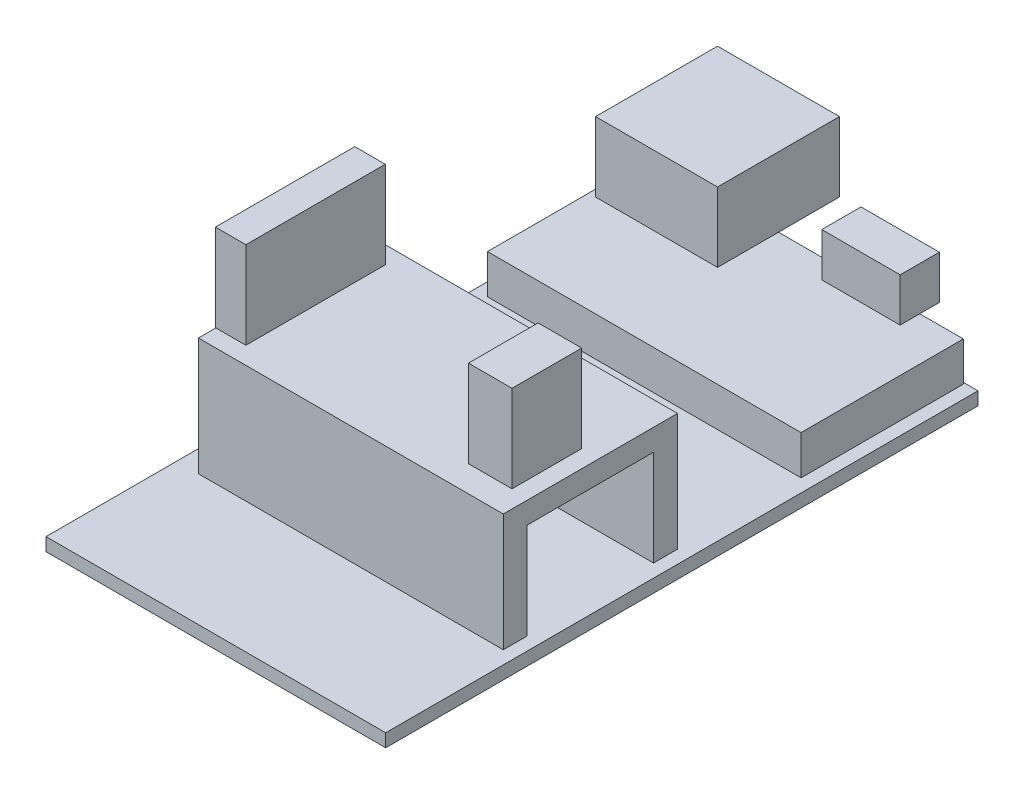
ISO-10303-21;
HEADER;
FILE_DESCRIPTION(('STEP AP214'),'2;1');
FILE_NAME('part.step','',(''),(''),'','','');
FILE_SCHEMA(('AUTOMOTIVE_DESIGN { 1 0 10303 214 1 1 1 1 }'));
ENDSEC;
DATA;
#1=APPLICATION_CONTEXT('core data for automotive mechanical design processes');
#2=APPLICATION_PROTOCOL_DEFINITION('international standard','automotive_design',2000,#1);
#3=PRODUCT_CONTEXT('',#1,'mechanical');
#4=PRODUCT('Part','Part','',(#3));
#5=PRODUCT_RELATED_PRODUCT_CATEGORY('part','',(#4));
#6=PRODUCT_DEFINITION_FORMATION('','',#4);
#7=PRODUCT_DEFINITION_CONTEXT('part definition',#1,'design');
#8=PRODUCT_DEFINITION('design','',#6,#7);
#9=PRODUCT_DEFINITION_SHAPE('','',#8);
#10=(LENGTH_UNIT() NAMED_UNIT(*) SI_UNIT(.MILLI.,.METRE.));
#11=(NAMED_UNIT(*) PLANE_ANGLE_UNIT() SI_UNIT($,.RADIAN.));
#12=(NAMED_UNIT(*) SI_UNIT($,.STERADIAN.) SOLID_ANGLE_UNIT());
#13=UNCERTAINTY_MEASURE_WITH_UNIT(LENGTH_MEASURE(1.E-05),#10,'distance_accuracy_value','');
#14=(GEOMETRIC_REPRESENTATION_CONTEXT(3) GLOBAL_UNCERTAINTY_ASSIGNED_CONTEXT((#13)) GLOBAL_UNIT_ASSIGNED_CONTEXT((#10,
#11,#12)) REPRESENTATION_CONTEXT('',''));
#15=CARTESIAN_POINT('',(0.,0.,0.));
#16=DIRECTION('',(0.,0.,1.));
#17=DIRECTION('',(1.,0.,0.));
#18=AXIS2_PLACEMENT_3D('',#15,#16,#17);
#19=CARTESIAN_POINT('',(0.,6.,0.));
#20=DIRECTION('',(0.,1.,0.));
#21=DIRECTION('',(0.,0.,1.));
#22=AXIS2_PLACEMENT_3D('',#19,#20,#21);
#23=PLANE('',#22);
#24=DIRECTION('',(-1.,0.,0.));
#25=VECTOR('',#24,1.);
#26=CARTESIAN_POINT('',(-18.,6.,-33.8120831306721));
#27=LINE('',#26,#25);
#28=CARTESIAN_POINT('',(18.,6.,-33.8120831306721));
#29=VERTEX_POINT('',#28);
#30=CARTESIAN_POINT('',(13.,6.,-33.8120831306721));
#31=VERTEX_POINT('',#30);
#32=EDGE_CURVE('E324',#29,#31,#27,.T.);
#33=ORIENTED_EDGE('',*,*,#32,.T.);
#34=DIRECTION('',(0.,0.,-1.));
#35=VECTOR('',#34,1.);
#36=CARTESIAN_POINT('',(13.,6.,-36.0620831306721));
#37=LINE('',#36,#35);
#38=CARTESIAN_POINT('',(13.,6.,-31.5620831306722));
#39=VERTEX_POINT('',#38);
#40=EDGE_CURVE('E55',#39,#31,#37,.T.);
#41=ORIENTED_EDGE('',*,*,#40,.F.);
#42=DIRECTION('',(1.,0.,0.));
#43=VECTOR('',#42,1.);
#44=CARTESIAN_POINT('',(4.,6.,-31.5620831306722));
#45=LINE('',#44,#43);
#46=CARTESIAN_POINT('',(4.,6.,-31.5620831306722));
#47=VERTEX_POINT('',#46);
#48=EDGE_CURVE('E50',#47,#39,#45,.T.);
#49=ORIENTED_EDGE('',*,*,#48,.F.);
#50=DIRECTION('',(0.,0.,1.));
#51=VECTOR('',#50,1.);
#52=CARTESIAN_POINT('',(4.,6.,-36.0620831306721));
#53=LINE('',#52,#51);
#54=CARTESIAN_POINT('',(4.,6.,-33.8120831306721));
#55=VERTEX_POINT('',#54);
#56=EDGE_CURVE('E542',#55,#47,#53,.T.);
#57=ORIENTED_EDGE('',*,*,#56,.F.);
#58=CARTESIAN_POINT('',(-3.21742454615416,6.,-33.8120831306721));
#59=VERTEX_POINT('',#58);
#60=EDGE_CURVE('E328',#55,#59,#27,.T.);
#61=ORIENTED_EDGE('',*,*,#60,.T.);
#62=DIRECTION('',(0.,0.,1.));
#63=VECTOR('',#62,1.);
#64=CARTESIAN_POINT('',(-3.21742454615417,6.,-40.8120831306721));
#65=LINE('',#64,#63);
#66=CARTESIAN_POINT('',(-3.21742454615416,6.,-26.8120831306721));
#67=VERTEX_POINT('',#66);
#68=EDGE_CURVE('E11',#59,#67,#65,.T.);
#69=ORIENTED_EDGE('',*,*,#68,.T.);
#70=DIRECTION('',(1.,0.,0.));
#71=VECTOR('',#70,1.);
#72=CARTESIAN_POINT('',(-17.2174245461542,6.,-26.8120831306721));
#73=LINE('',#72,#71);
#74=CARTESIAN_POINT('',(-17.2174245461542,6.,-26.8120831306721));
#75=VERTEX_POINT('',#74);
#76=EDGE_CURVE('E306',#75,#67,#73,.T.);
#77=ORIENTED_EDGE('',*,*,#76,.F.);
#78=DIRECTION('',(0.,0.,1.));
#79=VECTOR('',#78,1.);
#80=CARTESIAN_POINT('',(-17.2174245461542,6.,-40.8120831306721));
#81=LINE('',#80,#79);
#82=CARTESIAN_POINT('',(-17.2174245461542,6.,-33.8120831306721));
#83=VERTEX_POINT('',#82);
#84=EDGE_CURVE('E41',#83,#75,#81,.T.);
#85=ORIENTED_EDGE('',*,*,#84,.F.);
#86=CARTESIAN_POINT('',(-18.,6.,-33.8120831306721));
#87=VERTEX_POINT('',#86);
#88=EDGE_CURVE('E323',#83,#87,#27,.T.);
#89=ORIENTED_EDGE('',*,*,#88,.T.);
#90=DIRECTION('',(0.,0.,1.));
#91=VECTOR('',#90,1.);
#92=CARTESIAN_POINT('',(-18.,6.,-33.8120831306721));
#93=LINE('',#92,#91);
#94=CARTESIAN_POINT('',(-18.,6.,-15.1879168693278));
#95=VERTEX_POINT('',#94);
#96=EDGE_CURVE('E326',#87,#95,#93,.T.);
#97=ORIENTED_EDGE('',*,*,#96,.T.);
#98=DIRECTION('',(1.,0.,0.));
#99=VECTOR('',#98,1.);
#100=CARTESIAN_POINT('',(-18.,6.,-15.1879168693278));
#101=LINE('',#100,#99);
#102=CARTESIAN_POINT('',(18.,6.,-15.1879168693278));
#103=VERTEX_POINT('',#102);
#104=EDGE_CURVE('E331',#95,#103,#101,.T.);
#105=ORIENTED_EDGE('',*,*,#104,.T.);
#106=DIRECTION('',(0.,0.,-1.));
#107=VECTOR('',#106,1.);
#108=CARTESIAN_POINT('',(18.,6.,-33.8120831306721));
#109=LINE('',#108,#107);
#110=EDGE_CURVE('E313',#103,#29,#109,.T.);
#111=ORIENTED_EDGE('',*,*,#110,.T.);
#112=EDGE_LOOP('',(#33,#41,#49,#57,#61,#69,#77,#85,#89,#97,#105,#111));
#113=FACE_BOUND('',#112,.T.);
#114=ADVANCED_FACE('F32',(#113),#23,.T.);
#115=CARTESIAN_POINT('',(0.,1.5,0.));
#116=DIRECTION('',(0.,1.,0.));
#117=DIRECTION('',(0.,0.,1.));
#118=AXIS2_PLACEMENT_3D('',#115,#116,#117);
#119=PLANE('',#118);
#120=DIRECTION('',(-1.,0.,0.));
#121=VECTOR('',#120,1.);
#122=CARTESIAN_POINT('',(23.,1.5,16.2513258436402));
#123=LINE('',#122,#121);
#124=CARTESIAN_POINT('',(18.,1.5,16.2513258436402));
#125=VERTEX_POINT('',#124);
#126=CARTESIAN_POINT('',(-17.,1.5,16.2513258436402));
#127=VERTEX_POINT('',#126);
#128=EDGE_CURVE('E365',#125,#127,#123,.T.);
#129=ORIENTED_EDGE('',*,*,#128,.F.);
#130=DIRECTION('',(0.,0.,1.));
#131=VECTOR('',#130,1.);
#132=CARTESIAN_POINT('',(18.,1.5,0.));
#133=LINE('',#132,#131);
#134=CARTESIAN_POINT('',(18.,1.5,19.));
#135=VERTEX_POINT('',#134);
#136=EDGE_CURVE('E477',#125,#135,#133,.T.);
#137=ORIENTED_EDGE('',*,*,#136,.T.);
#138=DIRECTION('',(-1.,0.,0.));
#139=VECTOR('',#138,1.);
#140=CARTESIAN_POINT('',(0.,1.5,19.));
#141=LINE('',#140,#139);
#142=CARTESIAN_POINT('',(-17.,1.5,19.));
#143=VERTEX_POINT('',#142);
#144=EDGE_CURVE('E467',#135,#143,#141,.T.);
#145=ORIENTED_EDGE('',*,*,#144,.T.);
#146=DIRECTION('',(0.,0.,-1.));
#147=VECTOR('',#146,1.);
#148=CARTESIAN_POINT('',(-17.,1.5,0.));
#149=LINE('',#148,#147);
#150=EDGE_CURVE('E471',#143,#127,#149,.T.);
#151=ORIENTED_EDGE('',*,*,#150,.T.);
#152=EDGE_LOOP('',(#129,#137,#145,#151));
#153=FACE_BOUND('',#152,.T.);
#154=CARTESIAN_POINT('',(18.,1.5,-0.999999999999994));
#155=VERTEX_POINT('',#154);
#156=CARTESIAN_POINT('',(18.,1.5,1.74867415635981));
#157=VERTEX_POINT('',#156);
#158=EDGE_CURVE('E478',#155,#157,#133,.T.);
#159=ORIENTED_EDGE('',*,*,#158,.T.);
#160=DIRECTION('',(-1.,0.,0.));
#161=VECTOR('',#160,1.);
#162=CARTESIAN_POINT('',(23.,1.5,1.74867415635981));
#163=LINE('',#162,#161);
#164=CARTESIAN_POINT('',(-17.,1.5,1.74867415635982));
#165=VERTEX_POINT('',#164);
#166=EDGE_CURVE('E368',#157,#165,#163,.T.);
#167=ORIENTED_EDGE('',*,*,#166,.T.);
#168=CARTESIAN_POINT('',(-17.,1.5,-0.999999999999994));
#169=VERTEX_POINT('',#168);
#170=EDGE_CURVE('E470',#165,#169,#149,.T.);
#171=ORIENTED_EDGE('',*,*,#170,.T.);
#172=DIRECTION('',(1.,0.,0.));
#173=VECTOR('',#172,1.);
#174=CARTESIAN_POINT('',(0.,1.5,-0.999999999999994));
#175=LINE('',#174,#173);
#176=EDGE_CURVE('E474',#169,#155,#175,.T.);
#177=ORIENTED_EDGE('',*,*,#176,.T.);
#178=EDGE_LOOP('',(#159,#167,#171,#177));
#179=FACE_BOUND('',#178,.T.);
#180=DIRECTION('',(0.,0.,-1.));
#181=VECTOR('',#180,1.);
#182=CARTESIAN_POINT('',(19.5,1.5,-34.));
#183=LINE('',#182,#181);
#184=CARTESIAN_POINT('',(19.5,1.5,34.));
#185=VERTEX_POINT('',#184);
#186=CARTESIAN_POINT('',(19.5,1.5,-34.));
#187=VERTEX_POINT('',#186);
#188=EDGE_CURVE('E482',#185,#187,#183,.T.);
#189=ORIENTED_EDGE('',*,*,#188,.T.);
#190=DIRECTION('',(-1.,0.,0.));
#191=VECTOR('',#190,1.);
#192=CARTESIAN_POINT('',(-19.5,1.5,-34.));
#193=LINE('',#192,#191);
#194=CARTESIAN_POINT('',(-19.5,1.5,-34.));
#195=VERTEX_POINT('',#194);
#196=EDGE_CURVE('E484',#187,#195,#193,.T.);
#197=ORIENTED_EDGE('',*,*,#196,.T.);
#198=DIRECTION('',(0.,0.,1.));
#199=VECTOR('',#198,1.);
#200=CARTESIAN_POINT('',(-19.5,1.5,-34.));
#201=LINE('',#200,#199);
#202=CARTESIAN_POINT('',(-19.5,1.5,34.));
#203=VERTEX_POINT('',#202);
#204=EDGE_CURVE('E487',#195,#203,#201,.T.);
#205=ORIENTED_EDGE('',*,*,#204,.T.);
#206=DIRECTION('',(1.,0.,0.));
#207=VECTOR('',#206,1.);
#208=CARTESIAN_POINT('',(-19.5,1.5,34.));
#209=LINE('',#208,#207);
#210=EDGE_CURVE('E489',#203,#185,#209,.T.);
#211=ORIENTED_EDGE('',*,*,#210,.T.);
#212=EDGE_LOOP('',(#189,#197,#205,#211));
#213=FACE_BOUND('',#212,.T.);
#214=DIRECTION('',(1.,0.,0.));
#215=VECTOR('',#214,1.);
#216=CARTESIAN_POINT('',(0.,1.5,-33.8120831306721));
#217=LINE('',#216,#215);
#218=CARTESIAN_POINT('',(-18.,1.5,-33.8120831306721));
#219=VERTEX_POINT('',#218);
#220=CARTESIAN_POINT('',(18.,1.5,-33.8120831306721));
#221=VERTEX_POINT('',#220);
#222=EDGE_CURVE('E350',#219,#221,#217,.T.);
#223=ORIENTED_EDGE('',*,*,#222,.T.);
#224=DIRECTION('',(0.,0.,1.));
#225=VECTOR('',#224,1.);
#226=CARTESIAN_POINT('',(18.,1.5,0.));
#227=LINE('',#226,#225);
#228=CARTESIAN_POINT('',(18.,1.5,-15.1879168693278));
#229=VERTEX_POINT('',#228);
#230=EDGE_CURVE('E353',#221,#229,#227,.T.);
#231=ORIENTED_EDGE('',*,*,#230,.T.);
#232=DIRECTION('',(-1.,0.,0.));
#233=VECTOR('',#232,1.);
#234=CARTESIAN_POINT('',(0.,1.5,-15.1879168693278));
#235=LINE('',#234,#233);
#236=CARTESIAN_POINT('',(-18.,1.5,-15.1879168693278));
#237=VERTEX_POINT('',#236);
#238=EDGE_CURVE('E344',#229,#237,#235,.T.);
#239=ORIENTED_EDGE('',*,*,#238,.T.);
#240=DIRECTION('',(0.,0.,-1.));
#241=VECTOR('',#240,1.);
#242=CARTESIAN_POINT('',(-18.,1.5,0.));
#243=LINE('',#242,#241);
#244=EDGE_CURVE('E347',#237,#219,#243,.T.);
#245=ORIENTED_EDGE('',*,*,#244,.T.);
#246=EDGE_LOOP('',(#223,#231,#239,#245));
#247=FACE_BOUND('',#246,.T.);
#248=ADVANCED_FACE('F577',(#153,#179,#213,#247),#119,.T.);
#249=CARTESIAN_POINT('',(0.,15.,0.));
#250=DIRECTION('',(0.,1.,0.));
#251=DIRECTION('',(0.,0.,1.));
#252=AXIS2_PLACEMENT_3D('',#249,#250,#251);
#253=PLANE('',#252);
#254=DIRECTION('',(1.,0.,0.));
#255=VECTOR('',#254,1.);
#256=CARTESIAN_POINT('',(-17.05,15.,17.));
#257=LINE('',#256,#255);
#258=CARTESIAN_POINT('',(-17.,15.,17.));
#259=VERTEX_POINT('',#258);
#260=CARTESIAN_POINT('',(-13.55,15.,17.));
#261=VERTEX_POINT('',#260);
#262=EDGE_CURVE('E433',#259,#261,#257,.T.);
#263=ORIENTED_EDGE('',*,*,#262,.F.);
#264=DIRECTION('',(0.,0.,1.));
#265=VECTOR('',#264,1.);
#266=CARTESIAN_POINT('',(-17.,15.,-0.999999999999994));
#267=LINE('',#266,#265);
#268=CARTESIAN_POINT('',(-17.,15.,19.));
#269=VERTEX_POINT('',#268);
#270=EDGE_CURVE('E450',#259,#269,#267,.T.);
#271=ORIENTED_EDGE('',*,*,#270,.T.);
#272=DIRECTION('',(1.,0.,0.));
#273=VECTOR('',#272,1.);
#274=CARTESIAN_POINT('',(-17.,15.,19.));
#275=LINE('',#274,#273);
#276=CARTESIAN_POINT('',(18.,15.,19.));
#277=VERTEX_POINT('',#276);
#278=EDGE_CURVE('E453',#269,#277,#275,.T.);
#279=ORIENTED_EDGE('',*,*,#278,.T.);
#280=DIRECTION('',(0.,0.,-1.));
#281=VECTOR('',#280,1.);
#282=CARTESIAN_POINT('',(18.,15.,-0.999999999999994));
#283=LINE('',#282,#281);
#284=CARTESIAN_POINT('',(18.,15.,-0.999999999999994));
#285=VERTEX_POINT('',#284);
#286=EDGE_CURVE('E445',#277,#285,#283,.T.);
#287=ORIENTED_EDGE('',*,*,#286,.T.);
#288=DIRECTION('',(-1.,0.,0.));
#289=VECTOR('',#288,1.);
#290=CARTESIAN_POINT('',(-17.,15.,-0.999999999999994));
#291=LINE('',#290,#289);
#292=CARTESIAN_POINT('',(-17.,15.,-0.999999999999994));
#293=VERTEX_POINT('',#292);
#294=EDGE_CURVE('E448',#285,#293,#291,.T.);
#295=ORIENTED_EDGE('',*,*,#294,.T.);
#296=CARTESIAN_POINT('',(-17.,15.,0.999999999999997));
#297=VERTEX_POINT('',#296);
#298=EDGE_CURVE('E451',#293,#297,#267,.T.);
#299=ORIENTED_EDGE('',*,*,#298,.T.);
#300=DIRECTION('',(-1.,0.,0.));
#301=VECTOR('',#300,1.);
#302=CARTESIAN_POINT('',(-17.05,15.,0.999999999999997));
#303=LINE('',#302,#301);
#304=CARTESIAN_POINT('',(-13.55,15.,0.999999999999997));
#305=VERTEX_POINT('',#304);
#306=EDGE_CURVE('E426',#305,#297,#303,.T.);
#307=ORIENTED_EDGE('',*,*,#306,.F.);
#308=DIRECTION('',(0.,0.,-1.));
#309=VECTOR('',#308,1.);
#310=CARTESIAN_POINT('',(-13.55,15.,0.999999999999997));
#311=LINE('',#310,#309);
#312=EDGE_CURVE('E411',#261,#305,#311,.T.);
#313=ORIENTED_EDGE('',*,*,#312,.F.);
#314=EDGE_LOOP('',(#263,#271,#279,#287,#295,#299,#307,#313));
#315=FACE_BOUND('',#314,.T.);
#316=DIRECTION('',(1.,0.,0.));
#317=VECTOR('',#316,1.);
#318=CARTESIAN_POINT('',(16.,15.,16.));
#319=LINE('',#318,#317);
#320=CARTESIAN_POINT('',(11.,15.,16.));
#321=VERTEX_POINT('',#320);
#322=CARTESIAN_POINT('',(16.,15.,16.));
#323=VERTEX_POINT('',#322);
#324=EDGE_CURVE('E396',#321,#323,#319,.T.);
#325=ORIENTED_EDGE('',*,*,#324,.F.);
#326=DIRECTION('',(0.,0.,1.));
#327=VECTOR('',#326,1.);
#328=CARTESIAN_POINT('',(11.,15.,8.00000000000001));
#329=LINE('',#328,#327);
#330=CARTESIAN_POINT('',(11.,15.,8.00000000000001));
#331=VERTEX_POINT('',#330);
#332=EDGE_CURVE('E382',#331,#321,#329,.T.);
#333=ORIENTED_EDGE('',*,*,#332,.F.);
#334=DIRECTION('',(-1.,0.,0.));
#335=VECTOR('',#334,1.);
#336=CARTESIAN_POINT('',(16.,15.,8.00000000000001));
#337=LINE('',#336,#335);
#338=CARTESIAN_POINT('',(16.,15.,8.00000000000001));
#339=VERTEX_POINT('',#338);
#340=EDGE_CURVE('E387',#339,#331,#337,.T.);
#341=ORIENTED_EDGE('',*,*,#340,.F.);
#342=DIRECTION('',(0.,0.,-1.));
#343=VECTOR('',#342,1.);
#344=CARTESIAN_POINT('',(16.,15.,8.00000000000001));
#345=LINE('',#344,#343);
#346=EDGE_CURVE('E398',#323,#339,#345,.T.);
#347=ORIENTED_EDGE('',*,*,#346,.F.);
#348=EDGE_LOOP('',(#325,#333,#341,#347));
#349=FACE_BOUND('',#348,.T.);
#350=ADVANCED_FACE('F582',(#315,#349),#253,.T.);
#351=CARTESIAN_POINT('',(19.5,1.5,-34.));
#352=DIRECTION('',(-1.,0.,0.));
#353=DIRECTION('',(0.,0.,1.));
#354=AXIS2_PLACEMENT_3D('',#351,#352,#353);
#355=PLANE('',#354);
#356=DIRECTION('',(0.,0.,-1.));
#357=VECTOR('',#356,1.);
#358=CARTESIAN_POINT('',(19.5,0.,-34.));
#359=LINE('',#358,#357);
#360=CARTESIAN_POINT('',(19.5,0.,34.));
#361=VERTEX_POINT('',#360);
#362=CARTESIAN_POINT('',(19.5,0.,-34.));
#363=VERTEX_POINT('',#362);
#364=EDGE_CURVE('E481',#361,#363,#359,.T.);
#365=ORIENTED_EDGE('',*,*,#364,.T.);
#366=DIRECTION('',(0.,-1.,0.));
#367=VECTOR('',#366,1.);
#368=CARTESIAN_POINT('',(19.5,1.5,-34.));
#369=LINE('',#368,#367);
#370=EDGE_CURVE('E36',#187,#363,#369,.T.);
#371=ORIENTED_EDGE('',*,*,#370,.F.);
#372=ORIENTED_EDGE('',*,*,#188,.F.);
#373=DIRECTION('',(0.,-1.,0.));
#374=VECTOR('',#373,1.);
#375=CARTESIAN_POINT('',(19.5,1.5,34.));
#376=LINE('',#375,#374);
#377=EDGE_CURVE('E491',#185,#361,#376,.T.);
#378=ORIENTED_EDGE('',*,*,#377,.T.);
#379=EDGE_LOOP('',(#365,#371,#372,#378));
#380=FACE_BOUND('',#379,.T.);
#381=ADVANCED_FACE('F34',(#380),#355,.F.);
#382=CARTESIAN_POINT('',(-19.5,1.5,-34.));
#383=DIRECTION('',(0.,0.,1.));
#384=DIRECTION('',(1.,0.,0.));
#385=AXIS2_PLACEMENT_3D('',#382,#383,#384);
#386=PLANE('',#385);
#387=DIRECTION('',(-1.,0.,0.));
#388=VECTOR('',#387,1.);
#389=CARTESIAN_POINT('',(-19.5,0.,-34.));
#390=LINE('',#389,#388);
#391=CARTESIAN_POINT('',(-19.5,0.,-34.));
#392=VERTEX_POINT('',#391);
#393=EDGE_CURVE('E494',#363,#392,#390,.T.);
#394=ORIENTED_EDGE('',*,*,#393,.T.);
#395=DIRECTION('',(0.,-1.,0.));
#396=VECTOR('',#395,1.);
#397=CARTESIAN_POINT('',(-19.5,1.5,-34.));
#398=LINE('',#397,#396);
#399=EDGE_CURVE('E503',#195,#392,#398,.T.);
#400=ORIENTED_EDGE('',*,*,#399,.F.);
#401=ORIENTED_EDGE('',*,*,#196,.F.);
#402=ORIENTED_EDGE('',*,*,#370,.T.);
#403=EDGE_LOOP('',(#394,#400,#401,#402));
#404=FACE_BOUND('',#403,.T.);
#405=ADVANCED_FACE('F686',(#404),#386,.F.);
#406=CARTESIAN_POINT('',(-19.5,1.5,-34.));
#407=DIRECTION('',(1.,0.,0.));
#408=DIRECTION('',(0.,0.,-1.));
#409=AXIS2_PLACEMENT_3D('',#406,#407,#408);
#410=PLANE('',#409);
#411=DIRECTION('',(0.,0.,1.));
#412=VECTOR('',#411,1.);
#413=CARTESIAN_POINT('',(-19.5,0.,-34.));
#414=LINE('',#413,#412);
#415=CARTESIAN_POINT('',(-19.5,0.,34.));
#416=VERTEX_POINT('',#415);
#417=EDGE_CURVE('E496',#392,#416,#414,.T.);
#418=ORIENTED_EDGE('',*,*,#417,.T.);
#419=DIRECTION('',(0.,-1.,0.));
#420=VECTOR('',#419,1.);
#421=CARTESIAN_POINT('',(-19.5,1.5,34.));
#422=LINE('',#421,#420);
#423=EDGE_CURVE('E501',#203,#416,#422,.T.);
#424=ORIENTED_EDGE('',*,*,#423,.F.);
#425=ORIENTED_EDGE('',*,*,#204,.F.);
#426=ORIENTED_EDGE('',*,*,#399,.T.);
#427=EDGE_LOOP('',(#418,#424,#425,#426));
#428=FACE_BOUND('',#427,.T.);
#429=ADVANCED_FACE('F683',(#428),#410,.F.);
#430=CARTESIAN_POINT('',(-19.5,1.5,34.));
#431=DIRECTION('',(0.,0.,-1.));
#432=DIRECTION('',(-1.,0.,0.));
#433=AXIS2_PLACEMENT_3D('',#430,#431,#432);
#434=PLANE('',#433);
#435=DIRECTION('',(1.,0.,0.));
#436=VECTOR('',#435,1.);
#437=CARTESIAN_POINT('',(-19.5,0.,34.));
#438=LINE('',#437,#436);
#439=EDGE_CURVE('E485',#416,#361,#438,.T.);
#440=ORIENTED_EDGE('',*,*,#439,.T.);
#441=ORIENTED_EDGE('',*,*,#377,.F.);
#442=ORIENTED_EDGE('',*,*,#210,.F.);
#443=ORIENTED_EDGE('',*,*,#423,.T.);
#444=EDGE_LOOP('',(#440,#441,#442,#443));
#445=FACE_BOUND('',#444,.T.);
#446=ADVANCED_FACE('F679',(#445),#434,.F.);
#447=CARTESIAN_POINT('',(0.,0.,0.));
#448=DIRECTION('',(0.,1.,0.));
#449=DIRECTION('',(0.,0.,1.));
#450=AXIS2_PLACEMENT_3D('',#447,#448,#449);
#451=PLANE('',#450);
#452=ORIENTED_EDGE('',*,*,#364,.F.);
#453=ORIENTED_EDGE('',*,*,#439,.F.);
#454=ORIENTED_EDGE('',*,*,#417,.F.);
#455=ORIENTED_EDGE('',*,*,#393,.F.);
#456=EDGE_LOOP('',(#452,#453,#454,#455));
#457=FACE_BOUND('',#456,.T.);
#458=ADVANCED_FACE('F674',(#457),#451,.F.);
#459=CARTESIAN_POINT('',(18.,15.,-0.999999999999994));
#460=DIRECTION('',(-1.,0.,0.));
#461=DIRECTION('',(0.,0.,1.));
#462=AXIS2_PLACEMENT_3D('',#459,#460,#461);
#463=PLANE('',#462);
#464=ORIENTED_EDGE('',*,*,#136,.F.);
#465=DIRECTION('',(0.,1.,0.));
#466=VECTOR('',#465,1.);
#467=CARTESIAN_POINT('',(18.,15.,16.2513258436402));
#468=LINE('',#467,#466);
#469=CARTESIAN_POINT('',(18.,12.519658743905,16.2513258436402));
#470=VERTEX_POINT('',#469);
#471=EDGE_CURVE('E379',#125,#470,#468,.T.);
#472=ORIENTED_EDGE('',*,*,#471,.T.);
#473=DIRECTION('',(0.,0.,-1.));
#474=VECTOR('',#473,1.);
#475=CARTESIAN_POINT('',(18.,12.519658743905,-0.999999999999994));
#476=LINE('',#475,#474);
#477=CARTESIAN_POINT('',(18.,12.519658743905,1.74867415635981));
#478=VERTEX_POINT('',#477);
#479=EDGE_CURVE('E367',#470,#478,#476,.T.);
#480=ORIENTED_EDGE('',*,*,#479,.T.);
#481=DIRECTION('',(0.,-1.,0.));
#482=VECTOR('',#481,1.);
#483=CARTESIAN_POINT('',(18.,15.,1.74867415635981));
#484=LINE('',#483,#482);
#485=EDGE_CURVE('E376',#478,#157,#484,.T.);
#486=ORIENTED_EDGE('',*,*,#485,.T.);
#487=ORIENTED_EDGE('',*,*,#158,.F.);
#488=DIRECTION('',(0.,-1.,0.));
#489=VECTOR('',#488,1.);
#490=CARTESIAN_POINT('',(18.,15.,-0.999999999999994));
#491=LINE('',#490,#489);
#492=EDGE_CURVE('E464',#285,#155,#491,.T.);
#493=ORIENTED_EDGE('',*,*,#492,.F.);
#494=ORIENTED_EDGE('',*,*,#286,.F.);
#495=DIRECTION('',(0.,-1.,0.));
#496=VECTOR('',#495,1.);
#497=CARTESIAN_POINT('',(18.,15.,19.));
#498=LINE('',#497,#496);
#499=EDGE_CURVE('E456',#277,#135,#498,.T.);
#500=ORIENTED_EDGE('',*,*,#499,.T.);
#501=EDGE_LOOP('',(#464,#472,#480,#486,#487,#493,#494,#500));
#502=FACE_BOUND('',#501,.T.);
#503=ADVANCED_FACE('F671',(#502),#463,.F.);
#504=CARTESIAN_POINT('',(-17.,15.,-0.999999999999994));
#505=DIRECTION('',(0.,0.,1.));
#506=DIRECTION('',(1.,0.,0.));
#507=AXIS2_PLACEMENT_3D('',#504,#505,#506);
#508=PLANE('',#507);
#509=ORIENTED_EDGE('',*,*,#176,.F.);
#510=DIRECTION('',(0.,-1.,0.));
#511=VECTOR('',#510,1.);
#512=CARTESIAN_POINT('',(-17.,15.,-0.999999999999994));
#513=LINE('',#512,#511);
#514=EDGE_CURVE('E461',#293,#169,#513,.T.);
#515=ORIENTED_EDGE('',*,*,#514,.F.);
#516=ORIENTED_EDGE('',*,*,#294,.F.);
#517=ORIENTED_EDGE('',*,*,#492,.T.);
#518=EDGE_LOOP('',(#509,#515,#516,#517));
#519=FACE_BOUND('',#518,.T.);
#520=ADVANCED_FACE('F667',(#519),#508,.F.);
#521=CARTESIAN_POINT('',(-17.,15.,-0.999999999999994));
#522=DIRECTION('',(1.,0.,0.));
#523=DIRECTION('',(0.,0.,-1.));
#524=AXIS2_PLACEMENT_3D('',#521,#522,#523);
#525=PLANE('',#524);
#526=DIRECTION('',(0.,0.,-1.));
#527=VECTOR('',#526,1.);
#528=CARTESIAN_POINT('',(-17.,12.519658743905,1.74867415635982));
#529=LINE('',#528,#527);
#530=CARTESIAN_POINT('',(-17.,12.519658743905,16.2513258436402));
#531=VERTEX_POINT('',#530);
#532=CARTESIAN_POINT('',(-17.,12.519658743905,1.74867415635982));
#533=VERTEX_POINT('',#532);
#534=EDGE_CURVE('E358',#531,#533,#529,.T.);
#535=ORIENTED_EDGE('',*,*,#534,.F.);
#536=DIRECTION('',(0.,1.,0.));
#537=VECTOR('',#536,1.);
#538=CARTESIAN_POINT('',(-17.,12.519658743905,16.2513258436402));
#539=LINE('',#538,#537);
#540=EDGE_CURVE('E356',#127,#531,#539,.T.);
#541=ORIENTED_EDGE('',*,*,#540,.F.);
#542=ORIENTED_EDGE('',*,*,#150,.F.);
#543=DIRECTION('',(0.,-1.,0.));
#544=VECTOR('',#543,1.);
#545=CARTESIAN_POINT('',(-17.,15.,19.));
#546=LINE('',#545,#544);
#547=EDGE_CURVE('E459',#269,#143,#546,.T.);
#548=ORIENTED_EDGE('',*,*,#547,.F.);
#549=ORIENTED_EDGE('',*,*,#270,.F.);
#550=EDGE_CURVE('E454',#297,#259,#267,.T.);
#551=ORIENTED_EDGE('',*,*,#550,.F.);
#552=ORIENTED_EDGE('',*,*,#298,.F.);
#553=ORIENTED_EDGE('',*,*,#514,.T.);
#554=ORIENTED_EDGE('',*,*,#170,.F.);
#555=DIRECTION('',(0.,-1.,0.));
#556=VECTOR('',#555,1.);
#557=CARTESIAN_POINT('',(-17.,12.519658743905,1.74867415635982));
#558=LINE('',#557,#556);
#559=EDGE_CURVE('E361',#533,#165,#558,.T.);
#560=ORIENTED_EDGE('',*,*,#559,.F.);
#561=EDGE_LOOP('',(#535,#541,#542,#548,#549,#551,#552,#553,#554,#560));
#562=FACE_BOUND('',#561,.T.);
#563=ADVANCED_FACE('F663',(#562),#525,.F.);
#564=CARTESIAN_POINT('',(-17.,15.,19.));
#565=DIRECTION('',(0.,0.,-1.));
#566=DIRECTION('',(-1.,0.,0.));
#567=AXIS2_PLACEMENT_3D('',#564,#565,#566);
#568=PLANE('',#567);
#569=ORIENTED_EDGE('',*,*,#144,.F.);
#570=ORIENTED_EDGE('',*,*,#499,.F.);
#571=ORIENTED_EDGE('',*,*,#278,.F.);
#572=ORIENTED_EDGE('',*,*,#547,.T.);
#573=EDGE_LOOP('',(#569,#570,#571,#572));
#574=FACE_BOUND('',#573,.T.);
#575=ADVANCED_FACE('F643',(#574),#568,.F.);
#576=CARTESIAN_POINT('',(0.,15.,0.));
#577=DIRECTION('',(0.,1.,0.));
#578=DIRECTION('',(0.,0.,1.));
#579=AXIS2_PLACEMENT_3D('',#576,#577,#578);
#580=PLANE('',#579);
#581=CARTESIAN_POINT('',(-17.05,15.,0.999999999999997));
#582=VERTEX_POINT('',#581);
#583=EDGE_CURVE('E425',#297,#582,#303,.T.);
#584=ORIENTED_EDGE('',*,*,#583,.F.);
#585=ORIENTED_EDGE('',*,*,#550,.T.);
#586=CARTESIAN_POINT('',(-17.05,15.,17.));
#587=VERTEX_POINT('',#586);
#588=EDGE_CURVE('E416',#587,#259,#257,.T.);
#589=ORIENTED_EDGE('',*,*,#588,.F.);
#590=DIRECTION('',(0.,0.,1.));
#591=VECTOR('',#590,1.);
#592=CARTESIAN_POINT('',(-17.05,15.,0.999999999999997));
#593=LINE('',#592,#591);
#594=EDGE_CURVE('E429',#582,#587,#593,.T.);
#595=ORIENTED_EDGE('',*,*,#594,.F.);
#596=EDGE_LOOP('',(#584,#585,#589,#595));
#597=FACE_BOUND('',#596,.T.);
#598=ADVANCED_FACE('F639',(#597),#580,.F.);
#599=CARTESIAN_POINT('',(-13.55,25.,0.999999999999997));
#600=DIRECTION('',(-1.,0.,0.));
#601=DIRECTION('',(0.,0.,1.));
#602=AXIS2_PLACEMENT_3D('',#599,#600,#601);
#603=PLANE('',#602);
#604=ORIENTED_EDGE('',*,*,#312,.T.);
#605=DIRECTION('',(0.,-1.,0.));
#606=VECTOR('',#605,1.);
#607=CARTESIAN_POINT('',(-13.55,25.,0.999999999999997));
#608=LINE('',#607,#606);
#609=CARTESIAN_POINT('',(-13.55,25.,0.999999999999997));
#610=VERTEX_POINT('',#609);
#611=EDGE_CURVE('E442',#610,#305,#608,.T.);
#612=ORIENTED_EDGE('',*,*,#611,.F.);
#613=DIRECTION('',(0.,0.,-1.));
#614=VECTOR('',#613,1.);
#615=CARTESIAN_POINT('',(-13.55,25.,0.999999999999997));
#616=LINE('',#615,#614);
#617=CARTESIAN_POINT('',(-13.55,25.,17.));
#618=VERTEX_POINT('',#617);
#619=EDGE_CURVE('E412',#618,#610,#616,.T.);
#620=ORIENTED_EDGE('',*,*,#619,.F.);
#621=DIRECTION('',(0.,-1.,0.));
#622=VECTOR('',#621,1.);
#623=CARTESIAN_POINT('',(-13.55,25.,17.));
#624=LINE('',#623,#622);
#625=EDGE_CURVE('E422',#618,#261,#624,.T.);
#626=ORIENTED_EDGE('',*,*,#625,.T.);
#627=EDGE_LOOP('',(#604,#612,#620,#626));
#628=FACE_BOUND('',#627,.T.);
#629=ADVANCED_FACE('F642',(#628),#603,.F.);
#630=CARTESIAN_POINT('',(-17.05,25.,0.999999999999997));
#631=DIRECTION('',(0.,0.,1.));
#632=DIRECTION('',(1.,0.,0.));
#633=AXIS2_PLACEMENT_3D('',#630,#631,#632);
#634=PLANE('',#633);
#635=ORIENTED_EDGE('',*,*,#306,.T.);
#636=ORIENTED_EDGE('',*,*,#583,.T.);
#637=DIRECTION('',(0.,-1.,0.));
#638=VECTOR('',#637,1.);
#639=CARTESIAN_POINT('',(-17.05,25.,0.999999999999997));
#640=LINE('',#639,#638);
#641=CARTESIAN_POINT('',(-17.05,25.,0.999999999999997));
#642=VERTEX_POINT('',#641);
#643=EDGE_CURVE('E439',#642,#582,#640,.T.);
#644=ORIENTED_EDGE('',*,*,#643,.F.);
#645=DIRECTION('',(-1.,0.,0.));
#646=VECTOR('',#645,1.);
#647=CARTESIAN_POINT('',(-17.05,25.,0.999999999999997));
#648=LINE('',#647,#646);
#649=EDGE_CURVE('E415',#610,#642,#648,.T.);
#650=ORIENTED_EDGE('',*,*,#649,.F.);
#651=ORIENTED_EDGE('',*,*,#611,.T.);
#652=EDGE_LOOP('',(#635,#636,#644,#650,#651));
#653=FACE_BOUND('',#652,.T.);
#654=ADVANCED_FACE('F650',(#653),#634,.F.);
#655=CARTESIAN_POINT('',(-17.05,25.,0.999999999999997));
#656=DIRECTION('',(1.,0.,0.));
#657=DIRECTION('',(0.,0.,-1.));
#658=AXIS2_PLACEMENT_3D('',#655,#656,#657);
#659=PLANE('',#658);
#660=ORIENTED_EDGE('',*,*,#594,.T.);
#661=DIRECTION('',(0.,-1.,0.));
#662=VECTOR('',#661,1.);
#663=CARTESIAN_POINT('',(-17.05,25.,17.));
#664=LINE('',#663,#662);
#665=CARTESIAN_POINT('',(-17.05,25.,17.));
#666=VERTEX_POINT('',#665);
#667=EDGE_CURVE('E436',#666,#587,#664,.T.);
#668=ORIENTED_EDGE('',*,*,#667,.F.);
#669=DIRECTION('',(0.,0.,1.));
#670=VECTOR('',#669,1.);
#671=CARTESIAN_POINT('',(-17.05,25.,0.999999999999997));
#672=LINE('',#671,#670);
#673=EDGE_CURVE('E418',#642,#666,#672,.T.);
#674=ORIENTED_EDGE('',*,*,#673,.F.);
#675=ORIENTED_EDGE('',*,*,#643,.T.);
#676=EDGE_LOOP('',(#660,#668,#674,#675));
#677=FACE_BOUND('',#676,.T.);
#678=ADVANCED_FACE('F647',(#677),#659,.F.);
#679=CARTESIAN_POINT('',(-17.05,25.,17.));
#680=DIRECTION('',(0.,0.,-1.));
#681=DIRECTION('',(-1.,0.,0.));
#682=AXIS2_PLACEMENT_3D('',#679,#680,#681);
#683=PLANE('',#682);
#684=ORIENTED_EDGE('',*,*,#588,.T.);
#685=ORIENTED_EDGE('',*,*,#262,.T.);
#686=ORIENTED_EDGE('',*,*,#625,.F.);
#687=DIRECTION('',(1.,0.,0.));
#688=VECTOR('',#687,1.);
#689=CARTESIAN_POINT('',(-17.05,25.,17.));
#690=LINE('',#689,#688);
#691=EDGE_CURVE('E420',#666,#618,#690,.T.);
#692=ORIENTED_EDGE('',*,*,#691,.F.);
#693=ORIENTED_EDGE('',*,*,#667,.T.);
#694=EDGE_LOOP('',(#684,#685,#686,#692,#693));
#695=FACE_BOUND('',#694,.T.);
#696=ADVANCED_FACE('F637',(#695),#683,.F.);
#697=CARTESIAN_POINT('',(0.,25.,0.));
#698=DIRECTION('',(0.,1.,0.));
#699=DIRECTION('',(0.,0.,1.));
#700=AXIS2_PLACEMENT_3D('',#697,#698,#699);
#701=PLANE('',#700);
#702=ORIENTED_EDGE('',*,*,#619,.T.);
#703=ORIENTED_EDGE('',*,*,#649,.T.);
#704=ORIENTED_EDGE('',*,*,#673,.T.);
#705=ORIENTED_EDGE('',*,*,#691,.T.);
#706=EDGE_LOOP('',(#702,#703,#704,#705));
#707=FACE_BOUND('',#706,.T.);
#708=ADVANCED_FACE('F633',(#707),#701,.T.);
#709=CARTESIAN_POINT('',(11.,25.,8.00000000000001));
#710=DIRECTION('',(1.,0.,0.));
#711=DIRECTION('',(0.,0.,-1.));
#712=AXIS2_PLACEMENT_3D('',#709,#710,#711);
#713=PLANE('',#712);
#714=ORIENTED_EDGE('',*,*,#332,.T.);
#715=DIRECTION('',(0.,-1.,0.));
#716=VECTOR('',#715,1.);
#717=CARTESIAN_POINT('',(11.,25.,16.));
#718=LINE('',#717,#716);
#719=CARTESIAN_POINT('',(11.,25.,16.));
#720=VERTEX_POINT('',#719);
#721=EDGE_CURVE('E409',#720,#321,#718,.T.);
#722=ORIENTED_EDGE('',*,*,#721,.F.);
#723=DIRECTION('',(0.,0.,1.));
#724=VECTOR('',#723,1.);
#725=CARTESIAN_POINT('',(11.,25.,8.00000000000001));
#726=LINE('',#725,#724);
#727=CARTESIAN_POINT('',(11.,25.,8.00000000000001));
#728=VERTEX_POINT('',#727);
#729=EDGE_CURVE('E383',#728,#720,#726,.T.);
#730=ORIENTED_EDGE('',*,*,#729,.F.);
#731=DIRECTION('',(0.,-1.,0.));
#732=VECTOR('',#731,1.);
#733=CARTESIAN_POINT('',(11.,25.,8.00000000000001));
#734=LINE('',#733,#732);
#735=EDGE_CURVE('E393',#728,#331,#734,.T.);
#736=ORIENTED_EDGE('',*,*,#735,.T.);
#737=EDGE_LOOP('',(#714,#722,#730,#736));
#738=FACE_BOUND('',#737,.T.);
#739=ADVANCED_FACE('F629',(#738),#713,.F.);
#740=CARTESIAN_POINT('',(16.,25.,16.));
#741=DIRECTION('',(0.,0.,-1.));
#742=DIRECTION('',(-1.,0.,0.));
#743=AXIS2_PLACEMENT_3D('',#740,#741,#742);
#744=PLANE('',#743);
#745=ORIENTED_EDGE('',*,*,#324,.T.);
#746=DIRECTION('',(0.,-1.,0.));
#747=VECTOR('',#746,1.);
#748=CARTESIAN_POINT('',(16.,25.,16.));
#749=LINE('',#748,#747);
#750=CARTESIAN_POINT('',(16.,25.,16.));
#751=VERTEX_POINT('',#750);
#752=EDGE_CURVE('E406',#751,#323,#749,.T.);
#753=ORIENTED_EDGE('',*,*,#752,.F.);
#754=DIRECTION('',(1.,0.,0.));
#755=VECTOR('',#754,1.);
#756=CARTESIAN_POINT('',(16.,25.,16.));
#757=LINE('',#756,#755);
#758=EDGE_CURVE('E386',#720,#751,#757,.T.);
#759=ORIENTED_EDGE('',*,*,#758,.F.);
#760=ORIENTED_EDGE('',*,*,#721,.T.);
#761=EDGE_LOOP('',(#745,#753,#759,#760));
#762=FACE_BOUND('',#761,.T.);
#763=ADVANCED_FACE('F625',(#762),#744,.F.);
#764=CARTESIAN_POINT('',(16.,25.,8.00000000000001));
#765=DIRECTION('',(-1.,0.,0.));
#766=DIRECTION('',(0.,0.,1.));
#767=AXIS2_PLACEMENT_3D('',#764,#765,#766);
#768=PLANE('',#767);
#769=ORIENTED_EDGE('',*,*,#346,.T.);
#770=DIRECTION('',(0.,-1.,0.));
#771=VECTOR('',#770,1.);
#772=CARTESIAN_POINT('',(16.,25.,8.00000000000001));
#773=LINE('',#772,#771);
#774=CARTESIAN_POINT('',(16.,25.,8.00000000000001));
#775=VERTEX_POINT('',#774);
#776=EDGE_CURVE('E404',#775,#339,#773,.T.);
#777=ORIENTED_EDGE('',*,*,#776,.F.);
#778=DIRECTION('',(0.,0.,-1.));
#779=VECTOR('',#778,1.);
#780=CARTESIAN_POINT('',(16.,25.,8.00000000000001));
#781=LINE('',#780,#779);
#782=EDGE_CURVE('E389',#751,#775,#781,.T.);
#783=ORIENTED_EDGE('',*,*,#782,.F.);
#784=ORIENTED_EDGE('',*,*,#752,.T.);
#785=EDGE_LOOP('',(#769,#777,#783,#784));
#786=FACE_BOUND('',#785,.T.);
#787=ADVANCED_FACE('F621',(#786),#768,.F.);
#788=CARTESIAN_POINT('',(16.,25.,8.00000000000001));
#789=DIRECTION('',(0.,0.,1.));
#790=DIRECTION('',(1.,0.,0.));
#791=AXIS2_PLACEMENT_3D('',#788,#789,#790);
#792=PLANE('',#791);
#793=ORIENTED_EDGE('',*,*,#340,.T.);
#794=ORIENTED_EDGE('',*,*,#735,.F.);
#795=DIRECTION('',(-1.,0.,0.));
#796=VECTOR('',#795,1.);
#797=CARTESIAN_POINT('',(16.,25.,8.00000000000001));
#798=LINE('',#797,#796);
#799=EDGE_CURVE('E391',#775,#728,#798,.T.);
#800=ORIENTED_EDGE('',*,*,#799,.F.);
#801=ORIENTED_EDGE('',*,*,#776,.T.);
#802=EDGE_LOOP('',(#793,#794,#800,#801));
#803=FACE_BOUND('',#802,.T.);
#804=ADVANCED_FACE('F617',(#803),#792,.F.);
#805=CARTESIAN_POINT('',(0.,25.,0.));
#806=DIRECTION('',(0.,-1.,0.));
#807=DIRECTION('',(0.,0.,-1.));
#808=AXIS2_PLACEMENT_3D('',#805,#806,#807);
#809=PLANE('',#808);
#810=ORIENTED_EDGE('',*,*,#729,.T.);
#811=ORIENTED_EDGE('',*,*,#758,.T.);
#812=ORIENTED_EDGE('',*,*,#782,.T.);
#813=ORIENTED_EDGE('',*,*,#799,.T.);
#814=EDGE_LOOP('',(#810,#811,#812,#813));
#815=FACE_BOUND('',#814,.T.);
#816=ADVANCED_FACE('F613',(#815),#809,.F.);
#817=CARTESIAN_POINT('',(23.,12.519658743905,16.2513258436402));
#818=DIRECTION('',(0.,0.,1.));
#819=DIRECTION('',(0.,-1.,0.));
#820=AXIS2_PLACEMENT_3D('',#817,#818,#819);
#821=PLANE('',#820);
#822=ORIENTED_EDGE('',*,*,#128,.T.);
#823=ORIENTED_EDGE('',*,*,#540,.T.);
#824=DIRECTION('',(-1.,0.,0.));
#825=VECTOR('',#824,1.);
#826=CARTESIAN_POINT('',(23.,12.519658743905,16.2513258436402));
#827=LINE('',#826,#825);
#828=EDGE_CURVE('E364',#470,#531,#827,.T.);
#829=ORIENTED_EDGE('',*,*,#828,.F.);
#830=ORIENTED_EDGE('',*,*,#471,.F.);
#831=EDGE_LOOP('',(#822,#823,#829,#830));
#832=FACE_BOUND('',#831,.T.);
#833=ADVANCED_FACE('F606',(#832),#821,.F.);
#834=CARTESIAN_POINT('',(23.,12.519658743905,1.74867415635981));
#835=DIRECTION('',(0.,0.,-1.));
#836=DIRECTION('',(-1.,0.,0.));
#837=AXIS2_PLACEMENT_3D('',#834,#835,#836);
#838=PLANE('',#837);
#839=DIRECTION('',(-1.,0.,0.));
#840=VECTOR('',#839,1.);
#841=CARTESIAN_POINT('',(23.,12.519658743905,1.74867415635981));
#842=LINE('',#841,#840);
#843=EDGE_CURVE('E370',#478,#533,#842,.T.);
#844=ORIENTED_EDGE('',*,*,#843,.T.);
#845=ORIENTED_EDGE('',*,*,#559,.T.);
#846=ORIENTED_EDGE('',*,*,#166,.F.);
#847=ORIENTED_EDGE('',*,*,#485,.F.);
#848=EDGE_LOOP('',(#844,#845,#846,#847));
#849=FACE_BOUND('',#848,.T.);
#850=ADVANCED_FACE('F603',(#849),#838,.F.);
#851=CARTESIAN_POINT('',(23.,12.519658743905,1.74867415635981));
#852=DIRECTION('',(0.,1.,0.));
#853=DIRECTION('',(0.,0.,1.));
#854=AXIS2_PLACEMENT_3D('',#851,#852,#853);
#855=PLANE('',#854);
#856=ORIENTED_EDGE('',*,*,#828,.T.);
#857=ORIENTED_EDGE('',*,*,#534,.T.);
#858=ORIENTED_EDGE('',*,*,#843,.F.);
#859=ORIENTED_EDGE('',*,*,#479,.F.);
#860=EDGE_LOOP('',(#856,#857,#858,#859));
#861=FACE_BOUND('',#860,.T.);
#862=ADVANCED_FACE('F601',(#861),#855,.F.);
#863=CARTESIAN_POINT('',(18.,6.,-33.8120831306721));
#864=DIRECTION('',(-1.,0.,0.));
#865=DIRECTION('',(0.,0.,1.));
#866=AXIS2_PLACEMENT_3D('',#863,#864,#865);
#867=PLANE('',#866);
#868=ORIENTED_EDGE('',*,*,#230,.F.);
#869=DIRECTION('',(0.,-1.,0.));
#870=VECTOR('',#869,1.);
#871=CARTESIAN_POINT('',(18.,6.,-33.8120831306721));
#872=LINE('',#871,#870);
#873=EDGE_CURVE('E341',#29,#221,#872,.T.);
#874=ORIENTED_EDGE('',*,*,#873,.F.);
#875=ORIENTED_EDGE('',*,*,#110,.F.);
#876=DIRECTION('',(0.,-1.,0.));
#877=VECTOR('',#876,1.);
#878=CARTESIAN_POINT('',(18.,6.,-15.1879168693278));
#879=LINE('',#878,#877);
#880=EDGE_CURVE('E333',#103,#229,#879,.T.);
#881=ORIENTED_EDGE('',*,*,#880,.T.);
#882=EDGE_LOOP('',(#868,#874,#875,#881));
#883=FACE_BOUND('',#882,.T.);
#884=ADVANCED_FACE('F598',(#883),#867,.F.);
#885=CARTESIAN_POINT('',(-18.,6.,-33.8120831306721));
#886=DIRECTION('',(0.,0.,1.));
#887=DIRECTION('',(1.,0.,0.));
#888=AXIS2_PLACEMENT_3D('',#885,#886,#887);
#889=PLANE('',#888);
#890=ORIENTED_EDGE('',*,*,#222,.F.);
#891=DIRECTION('',(0.,-1.,0.));
#892=VECTOR('',#891,1.);
#893=CARTESIAN_POINT('',(-18.,6.,-33.8120831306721));
#894=LINE('',#893,#892);
#895=EDGE_CURVE('E338',#87,#219,#894,.T.);
#896=ORIENTED_EDGE('',*,*,#895,.F.);
#897=ORIENTED_EDGE('',*,*,#88,.F.);
#898=EDGE_CURVE('E329',#59,#83,#27,.T.);
#899=ORIENTED_EDGE('',*,*,#898,.F.);
#900=ORIENTED_EDGE('',*,*,#60,.F.);
#901=EDGE_CURVE('E327',#31,#55,#27,.T.);
#902=ORIENTED_EDGE('',*,*,#901,.F.);
#903=ORIENTED_EDGE('',*,*,#32,.F.);
#904=ORIENTED_EDGE('',*,*,#873,.T.);
#905=EDGE_LOOP('',(#890,#896,#897,#899,#900,#902,#903,#904));
#906=FACE_BOUND('',#905,.T.);
#907=ADVANCED_FACE('F545',(#906),#889,.F.);
#908=CARTESIAN_POINT('',(-18.,6.,-33.8120831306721));
#909=DIRECTION('',(1.,0.,0.));
#910=DIRECTION('',(0.,0.,-1.));
#911=AXIS2_PLACEMENT_3D('',#908,#909,#910);
#912=PLANE('',#911);
#913=ORIENTED_EDGE('',*,*,#244,.F.);
#914=DIRECTION('',(0.,-1.,0.));
#915=VECTOR('',#914,1.);
#916=CARTESIAN_POINT('',(-18.,6.,-15.1879168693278));
#917=LINE('',#916,#915);
#918=EDGE_CURVE('E336',#95,#237,#917,.T.);
#919=ORIENTED_EDGE('',*,*,#918,.F.);
#920=ORIENTED_EDGE('',*,*,#96,.F.);
#921=ORIENTED_EDGE('',*,*,#895,.T.);
#922=EDGE_LOOP('',(#913,#919,#920,#921));
#923=FACE_BOUND('',#922,.T.);
#924=ADVANCED_FACE('F591',(#923),#912,.F.);
#925=CARTESIAN_POINT('',(-18.,6.,-15.1879168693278));
#926=DIRECTION('',(0.,0.,-1.));
#927=DIRECTION('',(-1.,0.,0.));
#928=AXIS2_PLACEMENT_3D('',#925,#926,#927);
#929=PLANE('',#928);
#930=ORIENTED_EDGE('',*,*,#238,.F.);
#931=ORIENTED_EDGE('',*,*,#880,.F.);
#932=ORIENTED_EDGE('',*,*,#104,.F.);
#933=ORIENTED_EDGE('',*,*,#918,.T.);
#934=EDGE_LOOP('',(#930,#931,#932,#933));
#935=FACE_BOUND('',#934,.T.);
#936=ADVANCED_FACE('F588',(#935),#929,.F.);
#937=CARTESIAN_POINT('',(-17.2174245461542,14.,-40.8120831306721));
#938=DIRECTION('',(0.,0.,-1.));
#939=DIRECTION('',(-1.,0.,0.));
#940=AXIS2_PLACEMENT_3D('',#937,#938,#939);
#941=PLANE('',#940);
#942=DIRECTION('',(1.,0.,0.));
#943=VECTOR('',#942,1.);
#944=CARTESIAN_POINT('',(-17.2174245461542,6.,-40.8120831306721));
#945=LINE('',#944,#943);
#946=CARTESIAN_POINT('',(-17.2174245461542,6.,-40.8120831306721));
#947=VERTEX_POINT('',#946);
#948=CARTESIAN_POINT('',(-3.21742454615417,6.,-40.8120831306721));
#949=VERTEX_POINT('',#948);
#950=EDGE_CURVE('E285',#947,#949,#945,.T.);
#951=ORIENTED_EDGE('',*,*,#950,.F.);
#952=DIRECTION('',(0.,-1.,0.));
#953=VECTOR('',#952,1.);
#954=CARTESIAN_POINT('',(-17.2174245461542,14.,-40.8120831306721));
#955=LINE('',#954,#953);
#956=CARTESIAN_POINT('',(-17.2174245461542,14.,-40.8120831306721));
#957=VERTEX_POINT('',#956);
#958=EDGE_CURVE('E311',#957,#947,#955,.T.);
#959=ORIENTED_EDGE('',*,*,#958,.F.);
#960=DIRECTION('',(1.,0.,0.));
#961=VECTOR('',#960,1.);
#962=CARTESIAN_POINT('',(-17.2174245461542,14.,-40.8120831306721));
#963=LINE('',#962,#961);
#964=CARTESIAN_POINT('',(-3.21742454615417,14.,-40.8120831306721));
#965=VERTEX_POINT('',#964);
#966=EDGE_CURVE('E293',#957,#965,#963,.T.);
#967=ORIENTED_EDGE('',*,*,#966,.T.);
#968=DIRECTION('',(0.,-1.,0.));
#969=VECTOR('',#968,1.);
#970=CARTESIAN_POINT('',(-3.21742454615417,14.,-40.8120831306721));
#971=LINE('',#970,#969);
#972=EDGE_CURVE('E303',#965,#949,#971,.T.);
#973=ORIENTED_EDGE('',*,*,#972,.T.);
#974=EDGE_LOOP('',(#951,#959,#967,#973));
#975=FACE_BOUND('',#974,.T.);
#976=ADVANCED_FACE('F537',(#975),#941,.T.);
#977=CARTESIAN_POINT('',(-17.2174245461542,14.,-40.8120831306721));
#978=DIRECTION('',(1.,0.,0.));
#979=DIRECTION('',(0.,0.,-1.));
#980=AXIS2_PLACEMENT_3D('',#977,#978,#979);
#981=PLANE('',#980);
#982=EDGE_CURVE('E297',#947,#83,#81,.T.);
#983=ORIENTED_EDGE('',*,*,#982,.T.);
#984=ORIENTED_EDGE('',*,*,#84,.T.);
#985=DIRECTION('',(0.,-1.,0.));
#986=VECTOR('',#985,1.);
#987=CARTESIAN_POINT('',(-17.2174245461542,14.,-26.8120831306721));
#988=LINE('',#987,#986);
#989=CARTESIAN_POINT('',(-17.2174245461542,14.,-26.8120831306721));
#990=VERTEX_POINT('',#989);
#991=EDGE_CURVE('E314',#990,#75,#988,.T.);
#992=ORIENTED_EDGE('',*,*,#991,.F.);
#993=DIRECTION('',(0.,0.,1.));
#994=VECTOR('',#993,1.);
#995=CARTESIAN_POINT('',(-17.2174245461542,14.,-40.8120831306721));
#996=LINE('',#995,#994);
#997=EDGE_CURVE('E302',#957,#990,#996,.T.);
#998=ORIENTED_EDGE('',*,*,#997,.F.);
#999=ORIENTED_EDGE('',*,*,#958,.T.);
#1000=EDGE_LOOP('',(#983,#984,#992,#998,#999));
#1001=FACE_BOUND('',#1000,.T.);
#1002=ADVANCED_FACE('F519',(#1001),#981,.F.);
#1003=CARTESIAN_POINT('',(-17.2174245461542,14.,-26.8120831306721));
#1004=DIRECTION('',(0.,0.,-1.));
#1005=DIRECTION('',(-1.,0.,0.));
#1006=AXIS2_PLACEMENT_3D('',#1003,#1004,#1005);
#1007=PLANE('',#1006);
#1008=ORIENTED_EDGE('',*,*,#76,.T.);
#1009=DIRECTION('',(0.,-1.,0.));
#1010=VECTOR('',#1009,1.);
#1011=CARTESIAN_POINT('',(-3.21742454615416,14.,-26.8120831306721));
#1012=LINE('',#1011,#1010);
#1013=CARTESIAN_POINT('',(-3.21742454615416,14.,-26.8120831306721));
#1014=VERTEX_POINT('',#1013);
#1015=EDGE_CURVE('E317',#1014,#67,#1012,.T.);
#1016=ORIENTED_EDGE('',*,*,#1015,.F.);
#1017=DIRECTION('',(1.,0.,0.));
#1018=VECTOR('',#1017,1.);
#1019=CARTESIAN_POINT('',(-17.2174245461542,14.,-26.8120831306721));
#1020=LINE('',#1019,#1018);
#1021=EDGE_CURVE('E300',#990,#1014,#1020,.T.);
#1022=ORIENTED_EDGE('',*,*,#1021,.F.);
#1023=ORIENTED_EDGE('',*,*,#991,.T.);
#1024=EDGE_LOOP('',(#1008,#1016,#1022,#1023));
#1025=FACE_BOUND('',#1024,.T.);
#1026=ADVANCED_FACE('F525',(#1025),#1007,.F.);
#1027=CARTESIAN_POINT('',(-3.21742454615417,14.,-40.8120831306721));
#1028=DIRECTION('',(1.,0.,0.));
#1029=DIRECTION('',(0.,0.,-1.));
#1030=AXIS2_PLACEMENT_3D('',#1027,#1028,#1029);
#1031=PLANE('',#1030);
#1032=EDGE_CURVE('E43',#949,#59,#65,.T.);
#1033=ORIENTED_EDGE('',*,*,#1032,.F.);
#1034=ORIENTED_EDGE('',*,*,#972,.F.);
#1035=DIRECTION('',(0.,0.,1.));
#1036=VECTOR('',#1035,1.);
#1037=CARTESIAN_POINT('',(-3.21742454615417,14.,-40.8120831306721));
#1038=LINE('',#1037,#1036);
#1039=EDGE_CURVE('E296',#965,#1014,#1038,.T.);
#1040=ORIENTED_EDGE('',*,*,#1039,.T.);
#1041=ORIENTED_EDGE('',*,*,#1015,.T.);
#1042=ORIENTED_EDGE('',*,*,#68,.F.);
#1043=EDGE_LOOP('',(#1033,#1034,#1040,#1041,#1042));
#1044=FACE_BOUND('',#1043,.T.);
#1045=ADVANCED_FACE('F541',(#1044),#1031,.T.);
#1046=CARTESIAN_POINT('',(0.,14.,0.));
#1047=DIRECTION('',(0.,-1.,0.));
#1048=DIRECTION('',(0.,0.,-1.));
#1049=AXIS2_PLACEMENT_3D('',#1046,#1047,#1048);
#1050=PLANE('',#1049);
#1051=ORIENTED_EDGE('',*,*,#966,.F.);
#1052=ORIENTED_EDGE('',*,*,#997,.T.);
#1053=ORIENTED_EDGE('',*,*,#1021,.T.);
#1054=ORIENTED_EDGE('',*,*,#1039,.F.);
#1055=EDGE_LOOP('',(#1051,#1052,#1053,#1054));
#1056=FACE_BOUND('',#1055,.T.);
#1057=ADVANCED_FACE('F530',(#1056),#1050,.F.);
#1058=CARTESIAN_POINT('',(0.,6.,0.));
#1059=DIRECTION('',(0.,-1.,0.));
#1060=DIRECTION('',(0.,0.,-1.));
#1061=AXIS2_PLACEMENT_3D('',#1058,#1059,#1060);
#1062=PLANE('',#1061);
#1063=ORIENTED_EDGE('',*,*,#1032,.T.);
#1064=ORIENTED_EDGE('',*,*,#898,.T.);
#1065=ORIENTED_EDGE('',*,*,#982,.F.);
#1066=ORIENTED_EDGE('',*,*,#950,.T.);
#1067=EDGE_LOOP('',(#1063,#1064,#1065,#1066));
#1068=FACE_BOUND('',#1067,.T.);
#1069=ADVANCED_FACE('F535',(#1068),#1062,.T.);
#1070=CARTESIAN_POINT('',(0.,6.,0.));
#1071=DIRECTION('',(0.,1.,0.));
#1072=DIRECTION('',(0.,0.,1.));
#1073=AXIS2_PLACEMENT_3D('',#1070,#1071,#1072);
#1074=PLANE('',#1073);
#1075=CARTESIAN_POINT('',(13.,6.,-36.0620831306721));
#1076=VERTEX_POINT('',#1075);
#1077=EDGE_CURVE('E283',#31,#1076,#37,.T.);
#1078=ORIENTED_EDGE('',*,*,#1077,.F.);
#1079=ORIENTED_EDGE('',*,*,#901,.T.);
#1080=CARTESIAN_POINT('',(4.,6.,-36.0620831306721));
#1081=VERTEX_POINT('',#1080);
#1082=EDGE_CURVE('E551',#1081,#55,#53,.T.);
#1083=ORIENTED_EDGE('',*,*,#1082,.F.);
#1084=DIRECTION('',(-1.,0.,0.));
#1085=VECTOR('',#1084,1.);
#1086=CARTESIAN_POINT('',(4.,6.,-36.0620831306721));
#1087=LINE('',#1086,#1085);
#1088=EDGE_CURVE('E558',#1076,#1081,#1087,.T.);
#1089=ORIENTED_EDGE('',*,*,#1088,.F.);
#1090=EDGE_LOOP('',(#1078,#1079,#1083,#1089));
#1091=FACE_BOUND('',#1090,.T.);
#1092=ADVANCED_FACE('F550',(#1091),#1074,.F.);
#1093=CARTESIAN_POINT('',(13.,11.,-36.0620831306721));
#1094=DIRECTION('',(-1.,0.,0.));
#1095=DIRECTION('',(0.,0.,1.));
#1096=AXIS2_PLACEMENT_3D('',#1093,#1094,#1095);
#1097=PLANE('',#1096);
#1098=ORIENTED_EDGE('',*,*,#40,.T.);
#1099=ORIENTED_EDGE('',*,*,#1077,.T.);
#1100=DIRECTION('',(0.,-1.,0.));
#1101=VECTOR('',#1100,1.);
#1102=CARTESIAN_POINT('',(13.,11.,-36.0620831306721));
#1103=LINE('',#1102,#1101);
#1104=CARTESIAN_POINT('',(13.,11.,-36.0620831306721));
#1105=VERTEX_POINT('',#1104);
#1106=EDGE_CURVE('E265',#1105,#1076,#1103,.T.);
#1107=ORIENTED_EDGE('',*,*,#1106,.F.);
#1108=DIRECTION('',(0.,0.,-1.));
#1109=VECTOR('',#1108,1.);
#1110=CARTESIAN_POINT('',(13.,11.,-36.0620831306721));
#1111=LINE('',#1110,#1109);
#1112=CARTESIAN_POINT('',(13.,11.,-31.5620831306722));
#1113=VERTEX_POINT('',#1112);
#1114=EDGE_CURVE('E271',#1113,#1105,#1111,.T.);
#1115=ORIENTED_EDGE('',*,*,#1114,.F.);
#1116=DIRECTION('',(0.,-1.,0.));
#1117=VECTOR('',#1116,1.);
#1118=CARTESIAN_POINT('',(13.,11.,-31.5620831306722));
#1119=LINE('',#1118,#1117);
#1120=EDGE_CURVE('E562',#1113,#39,#1119,.T.);
#1121=ORIENTED_EDGE('',*,*,#1120,.T.);
#1122=EDGE_LOOP('',(#1098,#1099,#1107,#1115,#1121));
#1123=FACE_BOUND('',#1122,.T.);
#1124=ADVANCED_FACE('F281',(#1123),#1097,.F.);
#1125=CARTESIAN_POINT('',(4.,11.,-36.0620831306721));
#1126=DIRECTION('',(0.,0.,1.));
#1127=DIRECTION('',(1.,0.,0.));
#1128=AXIS2_PLACEMENT_3D('',#1125,#1126,#1127);
#1129=PLANE('',#1128);
#1130=ORIENTED_EDGE('',*,*,#1088,.T.);
#1131=DIRECTION('',(0.,-1.,0.));
#1132=VECTOR('',#1131,1.);
#1133=CARTESIAN_POINT('',(4.,11.,-36.0620831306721));
#1134=LINE('',#1133,#1132);
#1135=CARTESIAN_POINT('',(4.,11.,-36.0620831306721));
#1136=VERTEX_POINT('',#1135);
#1137=EDGE_CURVE('E267',#1136,#1081,#1134,.T.);
#1138=ORIENTED_EDGE('',*,*,#1137,.F.);
#1139=DIRECTION('',(-1.,0.,0.));
#1140=VECTOR('',#1139,1.);
#1141=CARTESIAN_POINT('',(4.,11.,-36.0620831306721));
#1142=LINE('',#1141,#1140);
#1143=EDGE_CURVE('E261',#1105,#1136,#1142,.T.);
#1144=ORIENTED_EDGE('',*,*,#1143,.F.);
#1145=ORIENTED_EDGE('',*,*,#1106,.T.);
#1146=EDGE_LOOP('',(#1130,#1138,#1144,#1145));
#1147=FACE_BOUND('',#1146,.T.);
#1148=ADVANCED_FACE('F263',(#1147),#1129,.F.);
#1149=CARTESIAN_POINT('',(4.,11.,-36.0620831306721));
#1150=DIRECTION('',(1.,0.,0.));
#1151=DIRECTION('',(0.,0.,-1.));
#1152=AXIS2_PLACEMENT_3D('',#1149,#1150,#1151);
#1153=PLANE('',#1152);
#1154=ORIENTED_EDGE('',*,*,#1082,.T.);
#1155=ORIENTED_EDGE('',*,*,#56,.T.);
#1156=DIRECTION('',(0.,-1.,0.));
#1157=VECTOR('',#1156,1.);
#1158=CARTESIAN_POINT('',(4.,11.,-31.5620831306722));
#1159=LINE('',#1158,#1157);
#1160=CARTESIAN_POINT('',(4.,11.,-31.5620831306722));
#1161=VERTEX_POINT('',#1160);
#1162=EDGE_CURVE('E289',#1161,#47,#1159,.T.);
#1163=ORIENTED_EDGE('',*,*,#1162,.F.);
#1164=DIRECTION('',(0.,0.,1.));
#1165=VECTOR('',#1164,1.);
#1166=CARTESIAN_POINT('',(4.,11.,-36.0620831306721));
#1167=LINE('',#1166,#1165);
#1168=EDGE_CURVE('E270',#1136,#1161,#1167,.T.);
#1169=ORIENTED_EDGE('',*,*,#1168,.F.);
#1170=ORIENTED_EDGE('',*,*,#1137,.T.);
#1171=EDGE_LOOP('',(#1154,#1155,#1163,#1169,#1170));
#1172=FACE_BOUND('',#1171,.T.);
#1173=ADVANCED_FACE('F553',(#1172),#1153,.F.);
#1174=CARTESIAN_POINT('',(4.,11.,-31.5620831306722));
#1175=DIRECTION('',(0.,0.,-1.));
#1176=DIRECTION('',(-1.,0.,0.));
#1177=AXIS2_PLACEMENT_3D('',#1174,#1175,#1176);
#1178=PLANE('',#1177);
#1179=ORIENTED_EDGE('',*,*,#48,.T.);
#1180=ORIENTED_EDGE('',*,*,#1120,.F.);
#1181=DIRECTION('',(1.,0.,0.));
#1182=VECTOR('',#1181,1.);
#1183=CARTESIAN_POINT('',(4.,11.,-31.5620831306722));
#1184=LINE('',#1183,#1182);
#1185=EDGE_CURVE('E276',#1161,#1113,#1184,.T.);
#1186=ORIENTED_EDGE('',*,*,#1185,.F.);
#1187=ORIENTED_EDGE('',*,*,#1162,.T.);
#1188=EDGE_LOOP('',(#1179,#1180,#1186,#1187));
#1189=FACE_BOUND('',#1188,.T.);
#1190=ADVANCED_FACE('F564',(#1189),#1178,.F.);
#1191=CARTESIAN_POINT('',(0.,11.,0.));
#1192=DIRECTION('',(0.,1.,0.));
#1193=DIRECTION('',(0.,0.,1.));
#1194=AXIS2_PLACEMENT_3D('',#1191,#1192,#1193);
#1195=PLANE('',#1194);
#1196=ORIENTED_EDGE('',*,*,#1114,.T.);
#1197=ORIENTED_EDGE('',*,*,#1143,.T.);
#1198=ORIENTED_EDGE('',*,*,#1168,.T.);
#1199=ORIENTED_EDGE('',*,*,#1185,.T.);
#1200=EDGE_LOOP('',(#1196,#1197,#1198,#1199));
#1201=FACE_BOUND('',#1200,.T.);
#1202=ADVANCED_FACE('F274',(#1201),#1195,.T.);
#1203=CLOSED_SHELL('',(#114,#248,#350,#381,#405,#429,#446,#458,#503,#520,#563,#575,#598,#629,
#654,#678,#696,#708,#739,#763,#787,#804,#816,#833,#850,#862,#884,#907,#924,#936,#976,#1002,
#1026,#1045,#1057,#1069,#1092,#1124,#1148,#1173,#1190,#1202));
#1204=MANIFOLD_SOLID_BREP('B2',#1203);
#1205=ADVANCED_BREP_SHAPE_REPRESENTATION('',(#18,#1204),#14);
#1206=SHAPE_DEFINITION_REPRESENTATION(#9,#1205);
ENDSEC;
END-ISO-10303-21;
